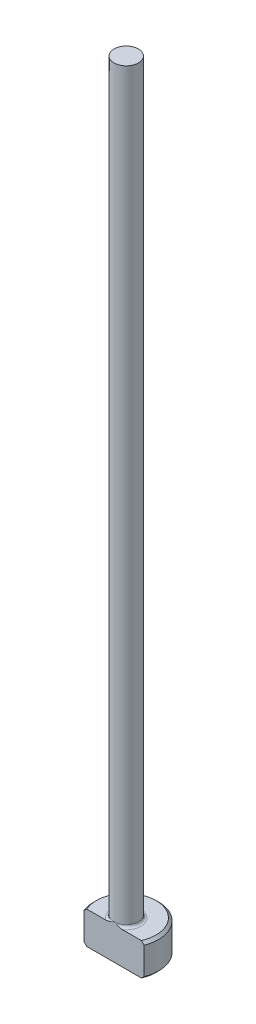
from build123d import *

# Parameters (mm, degrees)
CHAMFER1_SIZE = 0.254
FILLET1_R     = 0.254
KEY_DEPTH     = 77.332177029


with BuildPart() as part:
    # Sketch1 → Revolve1 (revolve)
    with BuildSketch(Plane.XY, mode=Mode.PRIVATE) as revolve1_sk:
        Polygon((0, 0), (-3.175, 0), (-3.175, 3.175), (-1.18999, 3.175), (-1.18999, 76.2), (0, 76.2), align=None)
    revolve(revolve1_sk.sketch.rotate(Axis((0, 259.958771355, 0), (0, -1, 0)), 270), axis=Axis((0, 259.958771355, 0), (0, -1, 0)))

    # Chamfer1
    chamfer1_edges = [part.edges().sort_by_distance(p)[0] for p in [
        (0, 3.175, -3.175),
        (0, 0, -3.175),
    ]]
    chamfer(chamfer1_edges, length=CHAMFER1_SIZE)

    # Fillet1
    fillet1_edges = [part.edges().sort_by_distance(p)[0] for p in [
        (0, 3.175, -1.18999),
    ]]
    fillet(fillet1_edges, radius=FILLET1_R)

    # Sketch2 → Key (cut, through all)
    with BuildSketch(Plane(origin=(0, 0, 0), x_dir=(1, 0, 0), z_dir=(0, 1, 0))):
        with BuildLine():
            Line((-2.943560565, -1.18999), (2.943560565, -1.18999))
            ThreePointArc((2.943560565, -1.18999), (0, -3.175), (-2.943560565, -1.18999))
        make_face()
    extrude(amount=KEY_DEPTH, mode=Mode.SUBTRACT)


solid = part.part
